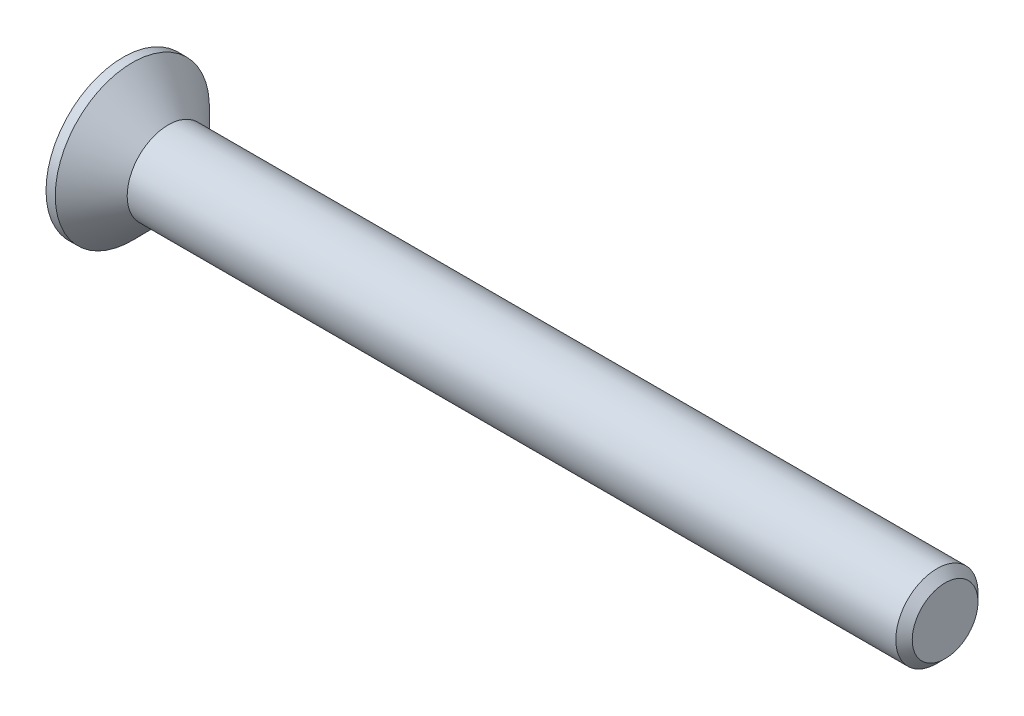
from build123d import *

# Parameters (mm, degrees)
CHAMFER1_SIZE      = 0.4
CUT_EXTRUDE1_DEPTH = 1.9


with BuildPart() as part:
    # Sketch1 → Revolve1 (revolve)
    with BuildSketch(Plane.XY, mode=Mode.PRIVATE) as revolve1_sk:
        Polygon((-2.2, 3.75), (-2.2, 0), (37.8, 0), (37.8, 2), (0, 2), (-1.75, 3.75), align=None)
    revolve(revolve1_sk.sketch.rotate(Axis((-2.2, 0, 0), (1, 0, 0)), 90), axis=Axis((-2.2, 0, 0), (1, 0, 0)))

    # Chamfer1
    chamfer1_edges = [part.edges().sort_by_distance(p)[0] for p in [
        (37.8, 0, -2),
    ]]
    chamfer(chamfer1_edges, length=CHAMFER1_SIZE)

    # Sketch2 → Cut-Extrude1 (cut)
    with BuildSketch(Plane.ZY.offset(2.2)):
        Polygon((-0.55, 2.2), (0.55, 2.2), (0.55, 0.55), (2.2, 0.55), (2.2, -0.55), (0.55, -0.55), (0.55, -2.2), (-0.55, -2.2), (-0.55, -0.55), (-2.2, -0.55), (-2.2, 0.55), (-0.55, 0.55), align=None)
    extrude(amount=-CUT_EXTRUDE1_DEPTH, mode=Mode.SUBTRACT)


solid = part.part
